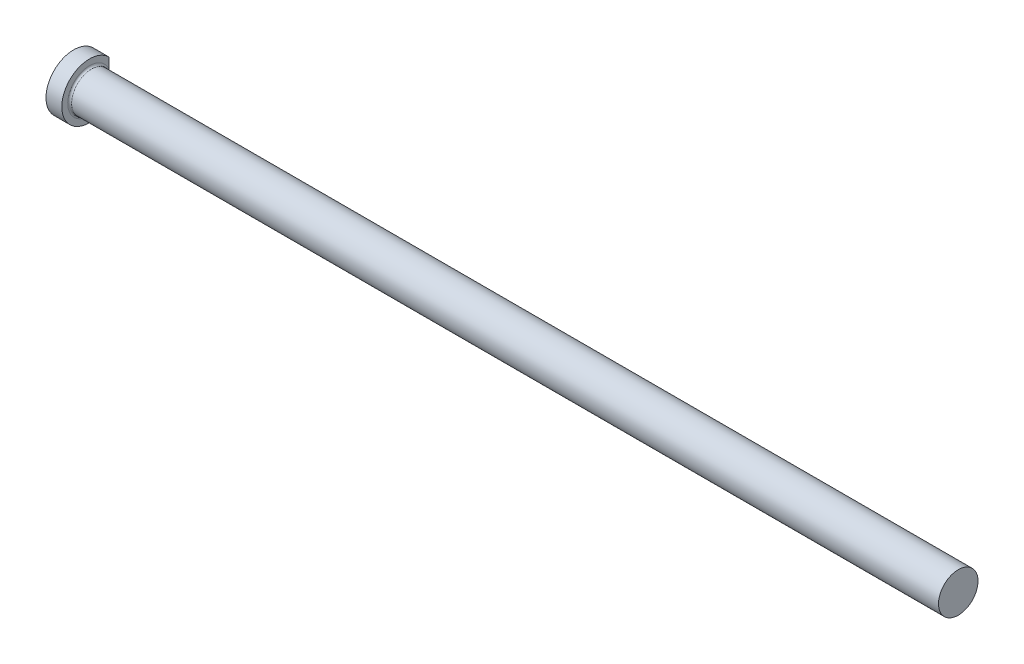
from build123d import *


with BuildPart() as part:
    # Sketch1 → PIN (revolve)
    with BuildSketch(Plane.XY, mode=Mode.PRIVATE) as pin_sk:
        with BuildLine():
            Line((0, 0), (0, 11.1125))
            Line((0, 11.1125), (6.35, 11.1125))
            Line((6.35, 11.1125), (6.35, 8.7249))
            ThreePointArc((6.35, 8.7249), (6.58062412, 8.16812412), (7.1374, 7.9375))
            Line((7.1374, 7.9375), (355.6, 7.9375))
            Line((355.6, 7.9375), (355.6, 0))
            Line((355.6, 0), (0, 0))
        make_face()
    revolve(pin_sk.sketch.rotate(Axis((355.6, 0, 0), (-1, 0, 0)), 180), axis=Axis((355.6, 0, 0), (-1, 0, 0)))

    # SurfaceCut1
    split(bisect_by=Plane(origin=(0, 0, -7.937754), x_dir=(-1, 0, 0), z_dir=(0, 0, -1)), keep=Keep.BOTTOM)


solid = part.part
